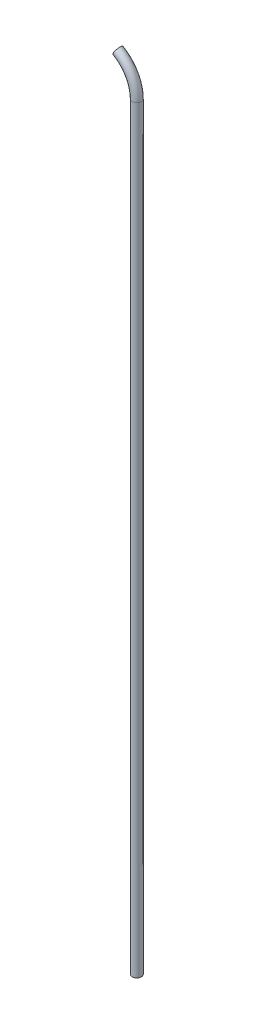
ISO-10303-21;
HEADER;
FILE_DESCRIPTION(('STEP AP214'),'2;1');
FILE_NAME('part.step','',(''),(''),'','','');
FILE_SCHEMA(('AUTOMOTIVE_DESIGN { 1 0 10303 214 1 1 1 1 }'));
ENDSEC;
DATA;
#1=APPLICATION_CONTEXT('core data for automotive mechanical design processes');
#2=APPLICATION_PROTOCOL_DEFINITION('international standard','automotive_design',2000,#1);
#3=PRODUCT_CONTEXT('',#1,'mechanical');
#4=PRODUCT('Part','Part','',(#3));
#5=PRODUCT_RELATED_PRODUCT_CATEGORY('part','',(#4));
#6=PRODUCT_DEFINITION_FORMATION('','',#4);
#7=PRODUCT_DEFINITION_CONTEXT('part definition',#1,'design');
#8=PRODUCT_DEFINITION('design','',#6,#7);
#9=PRODUCT_DEFINITION_SHAPE('','',#8);
#10=(LENGTH_UNIT() NAMED_UNIT(*) SI_UNIT(.MILLI.,.METRE.));
#11=(NAMED_UNIT(*) PLANE_ANGLE_UNIT() SI_UNIT($,.RADIAN.));
#12=(NAMED_UNIT(*) SI_UNIT($,.STERADIAN.) SOLID_ANGLE_UNIT());
#13=UNCERTAINTY_MEASURE_WITH_UNIT(LENGTH_MEASURE(1.E-05),#10,'distance_accuracy_value','');
#14=(GEOMETRIC_REPRESENTATION_CONTEXT(3) GLOBAL_UNCERTAINTY_ASSIGNED_CONTEXT((#13)) GLOBAL_UNIT_ASSIGNED_CONTEXT((#10,
#11,#12)) REPRESENTATION_CONTEXT('',''));
#15=CARTESIAN_POINT('',(0.,0.,0.));
#16=DIRECTION('',(0.,0.,1.));
#17=DIRECTION('',(1.,0.,0.));
#18=AXIS2_PLACEMENT_3D('',#15,#16,#17);
#19=CARTESIAN_POINT('',(1000.,8608.49364905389,0.));
#20=DIRECTION('',(0.,-1.,0.));
#21=DIRECTION('',(1.,0.,0.));
#22=AXIS2_PLACEMENT_3D('',#19,#20,#21);
#23=CYLINDRICAL_SURFACE('',#22,26.5);
#24=CARTESIAN_POINT('',(1000.,8608.49364905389,0.));
#25=DIRECTION('',(0.,1.,0.));
#26=DIRECTION('',(0.,0.,1.));
#27=AXIS2_PLACEMENT_3D('',#24,#25,#26);
#28=CIRCLE('',#27,26.5);
#29=CARTESIAN_POINT('',(1026.5,8608.49364905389,0.));
#30=VERTEX_POINT('',#29);
#31=EDGE_CURVE('E53',#30,#30,#28,.T.);
#32=ORIENTED_EDGE('',*,*,#31,.T.);
#33=EDGE_LOOP('',(#32));
#34=FACE_BOUND('',#33,.T.);
#35=CARTESIAN_POINT('',(1000.,3608.49364905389,0.));
#36=DIRECTION('',(0.,1.,0.));
#37=DIRECTION('',(0.,0.,1.));
#38=AXIS2_PLACEMENT_3D('',#35,#36,#37);
#39=CIRCLE('',#38,26.5);
#40=CARTESIAN_POINT('',(1000.,3608.49364905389,26.5));
#41=VERTEX_POINT('',#40);
#42=EDGE_CURVE('E41',#41,#41,#39,.T.);
#43=ORIENTED_EDGE('',*,*,#42,.F.);
#44=EDGE_LOOP('',(#43));
#45=FACE_BOUND('',#44,.T.);
#46=ADVANCED_FACE('F31',(#34,#45),#23,.F.);
#47=CARTESIAN_POINT('',(1000.,8608.49364905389,0.));
#48=DIRECTION('',(0.,-1.,0.));
#49=DIRECTION('',(1.,0.,0.));
#50=AXIS2_PLACEMENT_3D('',#47,#48,#49);
#51=CYLINDRICAL_SURFACE('',#50,30.15);
#52=CARTESIAN_POINT('',(1000.,8608.49364905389,0.));
#53=DIRECTION('',(0.,1.,0.));
#54=DIRECTION('',(0.,0.,1.));
#55=AXIS2_PLACEMENT_3D('',#52,#53,#54);
#56=CIRCLE('',#55,30.15);
#57=CARTESIAN_POINT('',(1030.15,8608.49364905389,0.));
#58=VERTEX_POINT('',#57);
#59=EDGE_CURVE('E10',#58,#58,#56,.T.);
#60=ORIENTED_EDGE('',*,*,#59,.F.);
#61=EDGE_LOOP('',(#60));
#62=FACE_BOUND('',#61,.T.);
#63=CARTESIAN_POINT('',(1000.,3608.49364905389,0.));
#64=DIRECTION('',(0.,1.,0.));
#65=DIRECTION('',(0.,0.,1.));
#66=AXIS2_PLACEMENT_3D('',#63,#64,#65);
#67=CIRCLE('',#66,30.15);
#68=CARTESIAN_POINT('',(1000.,3608.49364905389,30.15));
#69=VERTEX_POINT('',#68);
#70=EDGE_CURVE('E37',#69,#69,#67,.T.);
#71=ORIENTED_EDGE('',*,*,#70,.T.);
#72=EDGE_LOOP('',(#71));
#73=FACE_BOUND('',#72,.T.);
#74=ADVANCED_FACE('F72',(#62,#73),#51,.T.);
#75=CARTESIAN_POINT('',(1000.,3608.49364905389,0.));
#76=DIRECTION('',(0.,1.,0.));
#77=DIRECTION('',(0.,0.,1.));
#78=AXIS2_PLACEMENT_3D('',#75,#76,#77);
#79=PLANE('',#78);
#80=ORIENTED_EDGE('',*,*,#42,.T.);
#81=EDGE_LOOP('',(#80));
#82=FACE_BOUND('',#81,.T.);
#83=ORIENTED_EDGE('',*,*,#70,.F.);
#84=EDGE_LOOP('',(#83));
#85=FACE_BOUND('',#84,.T.);
#86=ADVANCED_FACE('F62',(#82,#85),#79,.F.);
#87=CARTESIAN_POINT('',(750.000000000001,8608.49364905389,0.));
#88=DIRECTION('',(0.,0.,-1.));
#89=DIRECTION('',(-1.,0.,0.));
#90=AXIS2_PLACEMENT_3D('',#87,#88,#89);
#91=TOROIDAL_SURFACE('',#90,250.,26.5);
#92=CARTESIAN_POINT('',(875.,8825.,0.));
#93=DIRECTION('',(-0.866025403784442,0.499999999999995,0.));
#94=DIRECTION('',(0.,0.,1.));
#95=AXIS2_PLACEMENT_3D('',#92,#93,#94);
#96=CIRCLE('',#95,26.5);
#97=CARTESIAN_POINT('',(888.25,8847.94967320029,0.));
#98=VERTEX_POINT('',#97);
#99=EDGE_CURVE('E50',#98,#98,#96,.T.);
#100=CARTESIAN_POINT('',(750.000000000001,8608.49364905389,0.));
#101=DIRECTION('',(0.,0.,-1.));
#102=DIRECTION('',(-1.,0.,0.));
#103=AXIS2_PLACEMENT_3D('',#100,#101,#102);
#104=CIRCLE('',#103,276.5);
#105=EDGE_CURVE('',#98,#30,#104,.T.);
#106=ORIENTED_EDGE('',*,*,#99,.T.);
#107=ORIENTED_EDGE('',*,*,#31,.F.);
#108=ORIENTED_EDGE('',*,*,#105,.T.);
#109=ORIENTED_EDGE('',*,*,#105,.F.);
#110=EDGE_LOOP('',(#106,#108,#107,#109));
#111=FACE_BOUND('',#110,.T.);
#112=ADVANCED_FACE('F59',(#111),#91,.F.);
#113=CARTESIAN_POINT('',(750.000000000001,8608.49364905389,0.));
#114=DIRECTION('',(0.,0.,-1.));
#115=DIRECTION('',(-1.,0.,0.));
#116=AXIS2_PLACEMENT_3D('',#113,#114,#115);
#117=TOROIDAL_SURFACE('',#116,250.,30.15);
#118=CARTESIAN_POINT('',(875.,8825.,0.));
#119=DIRECTION('',(-0.866025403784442,0.499999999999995,0.));
#120=DIRECTION('',(0.,0.,1.));
#121=AXIS2_PLACEMENT_3D('',#118,#119,#120);
#122=CIRCLE('',#121,30.15);
#123=CARTESIAN_POINT('',(890.075,8851.1106659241,0.));
#124=VERTEX_POINT('',#123);
#125=EDGE_CURVE('E45',#124,#124,#122,.T.);
#126=CARTESIAN_POINT('',(750.000000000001,8608.49364905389,0.));
#127=DIRECTION('',(0.,0.,-1.));
#128=DIRECTION('',(-1.,0.,0.));
#129=AXIS2_PLACEMENT_3D('',#126,#127,#128);
#130=CIRCLE('',#129,280.15);
#131=EDGE_CURVE('',#124,#58,#130,.T.);
#132=ORIENTED_EDGE('',*,*,#125,.F.);
#133=ORIENTED_EDGE('',*,*,#59,.T.);
#134=ORIENTED_EDGE('',*,*,#131,.T.);
#135=ORIENTED_EDGE('',*,*,#131,.F.);
#136=EDGE_LOOP('',(#132,#134,#133,#135));
#137=FACE_BOUND('',#136,.T.);
#138=ADVANCED_FACE('F61',(#137),#117,.T.);
#139=CARTESIAN_POINT('',(875.,8825.,0.));
#140=DIRECTION('',(-0.866025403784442,0.499999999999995,0.));
#141=DIRECTION('',(0.,0.,1.));
#142=AXIS2_PLACEMENT_3D('',#139,#140,#141);
#143=PLANE('',#142);
#144=ORIENTED_EDGE('',*,*,#99,.F.);
#145=EDGE_LOOP('',(#144));
#146=FACE_BOUND('',#145,.T.);
#147=ORIENTED_EDGE('',*,*,#125,.T.);
#148=EDGE_LOOP('',(#147));
#149=FACE_BOUND('',#148,.T.);
#150=ADVANCED_FACE('F65',(#146,#149),#143,.T.);
#151=CLOSED_SHELL('',(#46,#74,#86,#112,#138,#150));
#152=MANIFOLD_SOLID_BREP('B2',#151);
#153=ADVANCED_BREP_SHAPE_REPRESENTATION('',(#18,#152),#14);
#154=SHAPE_DEFINITION_REPRESENTATION(#9,#153);
ENDSEC;
END-ISO-10303-21;
